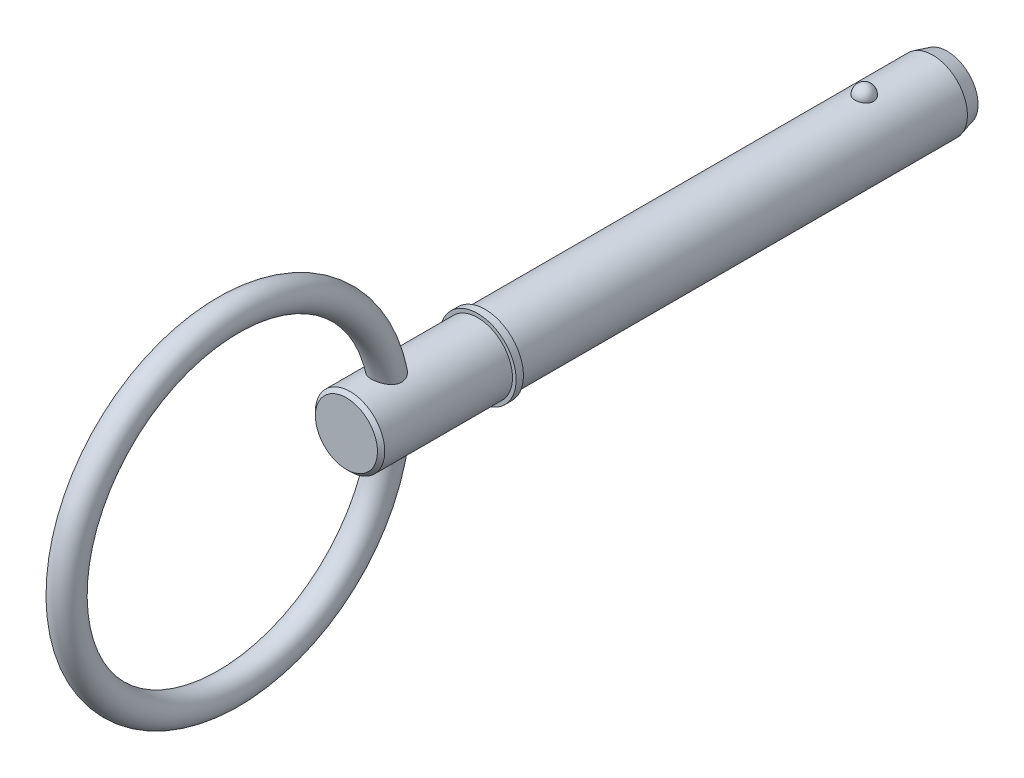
ISO-10303-21;
HEADER;
FILE_DESCRIPTION(('STEP AP214'),'2;1');
FILE_NAME('part.step','',(''),(''),'','','');
FILE_SCHEMA(('AUTOMOTIVE_DESIGN { 1 0 10303 214 1 1 1 1 }'));
ENDSEC;
DATA;
#1=APPLICATION_CONTEXT('core data for automotive mechanical design processes');
#2=APPLICATION_PROTOCOL_DEFINITION('international standard','automotive_design',2000,#1);
#3=PRODUCT_CONTEXT('',#1,'mechanical');
#4=PRODUCT('Part','Part','',(#3));
#5=PRODUCT_RELATED_PRODUCT_CATEGORY('part','',(#4));
#6=PRODUCT_DEFINITION_FORMATION('','',#4);
#7=PRODUCT_DEFINITION_CONTEXT('part definition',#1,'design');
#8=PRODUCT_DEFINITION('design','',#6,#7);
#9=PRODUCT_DEFINITION_SHAPE('','',#8);
#10=(LENGTH_UNIT() NAMED_UNIT(*) SI_UNIT(.MILLI.,.METRE.));
#11=(NAMED_UNIT(*) PLANE_ANGLE_UNIT() SI_UNIT($,.RADIAN.));
#12=(NAMED_UNIT(*) SI_UNIT($,.STERADIAN.) SOLID_ANGLE_UNIT());
#13=UNCERTAINTY_MEASURE_WITH_UNIT(LENGTH_MEASURE(1.E-05),#10,'distance_accuracy_value','');
#14=(GEOMETRIC_REPRESENTATION_CONTEXT(3) GLOBAL_UNCERTAINTY_ASSIGNED_CONTEXT((#13)) GLOBAL_UNIT_ASSIGNED_CONTEXT((#10,
#11,#12)) REPRESENTATION_CONTEXT('',''));
#15=CARTESIAN_POINT('',(0.,0.,0.));
#16=DIRECTION('',(0.,0.,1.));
#17=DIRECTION('',(1.,0.,0.));
#18=AXIS2_PLACEMENT_3D('',#15,#16,#17);
#19=CARTESIAN_POINT('',(0.,0.,50.8));
#20=DIRECTION('',(0.,0.,-1.));
#21=DIRECTION('',(-1.,0.,0.));
#22=AXIS2_PLACEMENT_3D('',#19,#20,#21);
#23=CYLINDRICAL_SURFACE('',#22,4.765);
#24=CARTESIAN_POINT('',(1.27812710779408,4.59038300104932,-1.29));
#25=CARTESIAN_POINT('',(1.27812572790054,4.59038414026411,-1.2178688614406));
#26=CARTESIAN_POINT('',(1.27223018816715,4.59203736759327,-1.14572000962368));
#27=CARTESIAN_POINT('',(1.24878929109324,4.59846646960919,-1.00346315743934));
#28=CARTESIAN_POINT('',(1.23123896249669,4.60324367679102,-0.933356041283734));
#29=CARTESIAN_POINT('',(1.18493861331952,4.61537801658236,-0.797215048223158));
#30=CARTESIAN_POINT('',(1.15619354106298,4.62273400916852,-0.731179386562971));
#31=CARTESIAN_POINT('',(1.08822596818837,4.6392032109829,-0.604986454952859));
#32=CARTESIAN_POINT('',(1.04900384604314,4.64831635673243,-0.544828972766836));
#33=CARTESIAN_POINT('',(0.960865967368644,4.66733302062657,-0.431775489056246));
#34=CARTESIAN_POINT('',(0.911906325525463,4.67723999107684,-0.37891426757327));
#35=CARTESIAN_POINT('',(0.805678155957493,4.69670280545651,-0.282245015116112));
#36=CARTESIAN_POINT('',(0.748409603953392,4.70625864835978,-0.238437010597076));
#37=CARTESIAN_POINT('',(0.627266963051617,4.72392767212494,-0.161207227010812));
#38=CARTESIAN_POINT('',(0.563411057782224,4.73204466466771,-0.127757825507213));
#39=CARTESIAN_POINT('',(0.430755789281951,4.74595788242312,-0.0720471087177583));
#40=CARTESIAN_POINT('',(0.361956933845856,4.75175434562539,-0.0497846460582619));
#41=CARTESIAN_POINT('',(0.222605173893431,4.76030056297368,-0.0173750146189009));
#42=CARTESIAN_POINT('',(0.152101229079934,4.76309991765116,-0.00703038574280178));
#43=CARTESIAN_POINT('',(0.0103009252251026,4.76551622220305,0.00191361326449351));
#44=CARTESIAN_POINT('',(-0.0609953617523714,4.76513345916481,0.000514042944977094));
#45=CARTESIAN_POINT('',(-0.201348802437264,4.76125496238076,-0.0138891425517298));
#46=CARTESIAN_POINT('',(-0.270423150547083,4.75780093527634,-0.0267372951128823));
#47=CARTESIAN_POINT('',(-0.405377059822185,4.74820737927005,-0.0634598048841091));
#48=CARTESIAN_POINT('',(-0.471256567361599,4.74206780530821,-0.0873343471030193));
#49=CARTESIAN_POINT('',(-0.598375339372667,4.72771507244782,-0.14561183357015));
#50=CARTESIAN_POINT('',(-0.659587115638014,4.71949070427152,-0.180071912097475));
#51=CARTESIAN_POINT('',(-0.775356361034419,4.70185936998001,-0.258542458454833));
#52=CARTESIAN_POINT('',(-0.8299131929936,4.69245229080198,-0.302553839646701));
#53=CARTESIAN_POINT('',(-0.931895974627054,4.67327936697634,-0.39982907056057));
#54=CARTESIAN_POINT('',(-0.979176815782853,4.66351011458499,-0.453244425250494));
#55=CARTESIAN_POINT('',(-1.06421220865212,4.64484426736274,-0.567321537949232));
#56=CARTESIAN_POINT('',(-1.10196613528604,4.63594772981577,-0.6279837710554));
#57=CARTESIAN_POINT('',(-1.16735225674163,4.61992036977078,-0.75558557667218));
#58=CARTESIAN_POINT('',(-1.19487251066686,4.61280933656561,-0.822585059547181));
#59=CARTESIAN_POINT('',(-1.23851975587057,4.60128324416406,-0.96041771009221));
#60=CARTESIAN_POINT('',(-1.25464705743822,4.59686811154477,-1.03125077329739));
#61=CARTESIAN_POINT('',(-1.27505790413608,4.59124882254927,-1.17443804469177));
#62=CARTESIAN_POINT('',(-1.27938868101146,4.59003186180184,-1.24678501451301));
#63=CARTESIAN_POINT('',(-1.27623192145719,4.5909105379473,-1.3911989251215));
#64=CARTESIAN_POINT('',(-1.26874468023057,4.59300609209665,-1.46326587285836));
#65=CARTESIAN_POINT('',(-1.24220427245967,4.60025423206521,-1.60473192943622));
#66=CARTESIAN_POINT('',(-1.2232043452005,4.60539274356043,-1.67414176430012));
#67=CARTESIAN_POINT('',(-1.17415910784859,4.61813957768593,-1.80870154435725));
#68=CARTESIAN_POINT('',(-1.1441133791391,4.62574799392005,-1.87385132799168));
#69=CARTESIAN_POINT('',(-1.07354327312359,4.64263368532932,-1.99841604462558));
#70=CARTESIAN_POINT('',(-1.03296580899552,4.65191934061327,-2.05779976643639));
#71=CARTESIAN_POINT('',(-0.942433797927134,4.67110036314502,-2.16881966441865));
#72=CARTESIAN_POINT('',(-0.892478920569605,4.68099575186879,-2.22045556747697));
#73=CARTESIAN_POINT('',(-0.784302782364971,4.70033161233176,-2.31471696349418));
#74=CARTESIAN_POINT('',(-0.726054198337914,4.70977043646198,-2.35731146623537));
#75=CARTESIAN_POINT('',(-0.602997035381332,4.72709995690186,-2.43206620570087));
#76=CARTESIAN_POINT('',(-0.538188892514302,4.73499075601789,-2.46422713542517));
#77=CARTESIAN_POINT('',(-0.404639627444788,4.7482563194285,-2.51687454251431));
#78=CARTESIAN_POINT('',(-0.335953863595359,4.7536596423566,-2.53749415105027));
#79=CARTESIAN_POINT('',(-0.195948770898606,4.76148510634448,-2.56703727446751));
#80=CARTESIAN_POINT('',(-0.124629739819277,4.76390758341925,-2.57596210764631));
#81=CARTESIAN_POINT('',(0.0172696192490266,4.76548774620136,-2.58180339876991));
#82=CARTESIAN_POINT('',(0.0878407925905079,4.76470225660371,-2.57892886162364));
#83=CARTESIAN_POINT('',(0.227467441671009,4.76008019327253,-2.56172603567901));
#84=CARTESIAN_POINT('',(0.296522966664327,4.75624371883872,-2.54739811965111));
#85=CARTESIAN_POINT('',(0.430942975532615,4.74595041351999,-2.50776251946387));
#86=CARTESIAN_POINT('',(0.496319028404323,4.7395023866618,-2.4824917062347));
#87=CARTESIAN_POINT('',(0.621860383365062,4.72467083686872,-2.4216730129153));
#88=CARTESIAN_POINT('',(0.682025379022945,4.71628720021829,-2.38612452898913));
#89=CARTESIAN_POINT('',(0.796409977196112,4.69833598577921,-2.30511163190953));
#90=CARTESIAN_POINT('',(0.850529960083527,4.68875291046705,-2.25951003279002));
#91=CARTESIAN_POINT('',(0.950412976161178,4.66953243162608,-2.15992428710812));
#92=CARTESIAN_POINT('',(0.996174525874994,4.65989501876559,-2.10593865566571));
#93=CARTESIAN_POINT('',(1.07885962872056,4.64145616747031,-1.99009376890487));
#94=CARTESIAN_POINT('',(1.11562789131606,4.63267081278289,-1.92812106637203));
#95=CARTESIAN_POINT('',(1.17840570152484,4.61710269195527,-1.79873681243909));
#96=CARTESIAN_POINT('',(1.20441973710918,4.61031909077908,-1.73132754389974));
#97=CARTESIAN_POINT('',(1.24242116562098,4.60021170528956,-1.60192906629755));
#98=CARTESIAN_POINT('',(1.25578772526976,4.59655387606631,-1.54036674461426));
#99=CARTESIAN_POINT('',(1.27364121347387,4.59163904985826,-1.41587409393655));
#100=CARTESIAN_POINT('',(1.2781283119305,4.59038200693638,-1.35294379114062));
#101=CARTESIAN_POINT('',(1.27812710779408,4.59038300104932,-1.29));
#102=B_SPLINE_CURVE_WITH_KNOTS('',3,(#24,#25,#26,#27,#28,#29,#30,#31,#32,#33,#34,#35,#36,#37,
#38,#39,#40,#41,#42,#43,#44,#45,#46,#47,#48,#49,#50,#51,#52,#53,#54,#55,#56,#57,#58,#59,#60,#61,
#62,#63,#64,#65,#66,#67,#68,#69,#70,#71,#72,#73,#74,#75,#76,#77,#78,#79,#80,#81,#82,#83,#84,#85,
#86,#87,#88,#89,#90,#91,#92,#93,#94,#95,#96,#97,#98,#99,#100,#101),.UNSPECIFIED.,.T.,.F.,(4,2,2,
2,2,2,2,2,2,2,2,2,2,2,2,2,2,2,2,2,2,2,2,2,2,2,2,2,2,2,2,2,2,2,2,2,2,2,4),(0.,0.216167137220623,
0.432426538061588,0.648590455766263,0.864746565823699,1.0818998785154,1.29905382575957,
1.51562361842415,1.73217119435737,1.94507683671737,2.15796327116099,2.36800220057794,
2.57804465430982,2.78924132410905,3.00045819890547,3.21545551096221,3.43046692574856,
3.64776550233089,3.8650581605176,4.08147951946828,4.29789547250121,4.51331818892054,
4.72874907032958,4.94528769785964,5.16183395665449,5.37911087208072,5.59637335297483,
5.8110751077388,6.02575265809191,6.23664413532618,6.44752874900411,6.65770827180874,
6.86790014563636,7.08116060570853,7.29445887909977,7.51121476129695,7.72788009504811,
7.91651762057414,8.10515153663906),.UNSPECIFIED.);
#103=CARTESIAN_POINT('',(1.27812710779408,4.59038300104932,-1.29));
#104=VERTEX_POINT('',#103);
#105=EDGE_CURVE('E103',#104,#104,#102,.T.);
#106=ORIENTED_EDGE('',*,*,#105,.T.);
#107=EDGE_LOOP('',(#106));
#108=FACE_BOUND('',#107,.T.);
#109=CARTESIAN_POINT('',(0.,0.,-10.7));
#110=DIRECTION('',(0.,0.,-1.));
#111=DIRECTION('',(-1.,0.,0.));
#112=AXIS2_PLACEMENT_3D('',#109,#110,#111);
#113=CIRCLE('',#112,4.765);
#114=CARTESIAN_POINT('',(-4.765,0.,-10.7));
#115=VERTEX_POINT('',#114);
#116=EDGE_CURVE('E110',#115,#115,#113,.F.);
#117=ORIENTED_EDGE('',*,*,#116,.T.);
#118=EDGE_LOOP('',(#117));
#119=FACE_BOUND('',#118,.T.);
#120=CARTESIAN_POINT('',(0.,0.,50.8));
#121=DIRECTION('',(0.,0.,1.));
#122=DIRECTION('',(1.,0.,0.));
#123=AXIS2_PLACEMENT_3D('',#120,#121,#122);
#124=CIRCLE('',#123,4.765);
#125=CARTESIAN_POINT('',(4.765,0.,50.8));
#126=VERTEX_POINT('',#125);
#127=EDGE_CURVE('E108',#126,#126,#124,.T.);
#128=ORIENTED_EDGE('',*,*,#127,.F.);
#129=EDGE_LOOP('',(#128));
#130=FACE_BOUND('',#129,.T.);
#131=ADVANCED_FACE('F39',(#108,#119,#130),#23,.T.);
#132=CARTESIAN_POINT('',(0.,0.,-12.7));
#133=DIRECTION('',(0.,0.,-1.));
#134=DIRECTION('',(-1.,0.,0.));
#135=AXIS2_PLACEMENT_3D('',#132,#133,#134);
#136=PLANE('',#135);
#137=CARTESIAN_POINT('',(0.,0.,-12.7));
#138=DIRECTION('',(0.,0.,-1.));
#139=DIRECTION('',(-1.,0.,0.));
#140=AXIS2_PLACEMENT_3D('',#137,#138,#139);
#141=CIRCLE('',#140,4.22910161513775);
#142=CARTESIAN_POINT('',(-4.22910161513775,0.,-12.7));
#143=VERTEX_POINT('',#142);
#144=EDGE_CURVE('E141',#143,#143,#141,.T.);
#145=ORIENTED_EDGE('',*,*,#144,.T.);
#146=EDGE_LOOP('',(#145));
#147=FACE_BOUND('',#146,.T.);
#148=ADVANCED_FACE('F89',(#147),#136,.T.);
#149=CARTESIAN_POINT('',(0.,0.,-12.7));
#150=DIRECTION('',(0.,0.,1.));
#151=DIRECTION('',(1.,0.,0.));
#152=AXIS2_PLACEMENT_3D('',#149,#150,#151);
#153=CONICAL_SURFACE('',#152,4.22910161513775,0.261799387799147);
#154=ORIENTED_EDGE('',*,*,#116,.F.);
#155=EDGE_LOOP('',(#154));
#156=FACE_BOUND('',#155,.T.);
#157=ORIENTED_EDGE('',*,*,#144,.F.);
#158=EDGE_LOOP('',(#157));
#159=FACE_BOUND('',#158,.T.);
#160=ADVANCED_FACE('F95',(#156,#159),#153,.T.);
#161=CARTESIAN_POINT('',(0.,4.765,-1.29));
#162=DIRECTION('',(0.,1.,0.));
#163=DIRECTION('',(0.,0.,-1.));
#164=AXIS2_PLACEMENT_3D('',#161,#162,#163);
#165=SPHERICAL_SURFACE('',#164,1.29);
#166=ORIENTED_EDGE('',*,*,#105,.F.);
#167=EDGE_LOOP('',(#166));
#168=FACE_BOUND('',#167,.T.);
#169=ADVANCED_FACE('F113',(#168),#165,.T.);
#170=CARTESIAN_POINT('',(0.,0.,50.8));
#171=DIRECTION('',(0.,0.,-1.));
#172=DIRECTION('',(-1.,0.,0.));
#173=AXIS2_PLACEMENT_3D('',#170,#171,#172);
#174=PLANE('',#173);
#175=ORIENTED_EDGE('',*,*,#127,.T.);
#176=EDGE_LOOP('',(#175));
#177=FACE_BOUND('',#176,.T.);
#178=CARTESIAN_POINT('',(0.,0.,50.8));
#179=DIRECTION('',(0.,0.,-1.));
#180=DIRECTION('',(-1.,0.,0.));
#181=AXIS2_PLACEMENT_3D('',#178,#179,#180);
#182=CIRCLE('',#181,5.265);
#183=CARTESIAN_POINT('',(-5.265,0.,50.8));
#184=VERTEX_POINT('',#183);
#185=EDGE_CURVE('E109',#184,#184,#182,.T.);
#186=ORIENTED_EDGE('',*,*,#185,.T.);
#187=EDGE_LOOP('',(#186));
#188=FACE_BOUND('',#187,.T.);
#189=ADVANCED_FACE('F117',(#177,#188),#174,.T.);
#190=CARTESIAN_POINT('',(0.,0.,33.7287874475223));
#191=DIRECTION('',(0.,0.,-1.));
#192=DIRECTION('',(-1.,0.,0.));
#193=AXIS2_PLACEMENT_3D('',#190,#191,#192);
#194=CYLINDRICAL_SURFACE('',#193,5.265);
#195=CARTESIAN_POINT('',(0.,0.,51.8));
#196=DIRECTION('',(0.,0.,-1.));
#197=DIRECTION('',(-1.,0.,0.));
#198=AXIS2_PLACEMENT_3D('',#195,#196,#197);
#199=CIRCLE('',#198,5.265);
#200=CARTESIAN_POINT('',(-5.265,0.,51.8));
#201=VERTEX_POINT('',#200);
#202=EDGE_CURVE('E134',#201,#201,#199,.T.);
#203=ORIENTED_EDGE('',*,*,#202,.T.);
#204=EDGE_LOOP('',(#203));
#205=FACE_BOUND('',#204,.T.);
#206=ORIENTED_EDGE('',*,*,#185,.F.);
#207=EDGE_LOOP('',(#206));
#208=FACE_BOUND('',#207,.T.);
#209=ADVANCED_FACE('F121',(#205,#208),#194,.T.);
#210=CARTESIAN_POINT('',(0.,5.265,51.8));
#211=DIRECTION('',(0.,0.,1.));
#212=DIRECTION('',(1.,0.,0.));
#213=AXIS2_PLACEMENT_3D('',#210,#211,#212);
#214=PLANE('',#213);
#215=CARTESIAN_POINT('',(0.,0.,51.8));
#216=DIRECTION('',(0.,0.,1.));
#217=DIRECTION('',(1.,0.,0.));
#218=AXIS2_PLACEMENT_3D('',#215,#216,#217);
#219=CIRCLE('',#218,4.765);
#220=CARTESIAN_POINT('',(4.765,0.,51.8));
#221=VERTEX_POINT('',#220);
#222=EDGE_CURVE('E112',#221,#221,#219,.T.);
#223=ORIENTED_EDGE('',*,*,#222,.F.);
#224=EDGE_LOOP('',(#223));
#225=FACE_BOUND('',#224,.T.);
#226=ORIENTED_EDGE('',*,*,#202,.F.);
#227=EDGE_LOOP('',(#226));
#228=FACE_BOUND('',#227,.T.);
#229=ADVANCED_FACE('F86',(#225,#228),#214,.T.);
#230=CARTESIAN_POINT('',(0.,0.,69.85));
#231=DIRECTION('',(0.,0.,-1.));
#232=DIRECTION('',(-1.,0.,0.));
#233=AXIS2_PLACEMENT_3D('',#230,#231,#232);
#234=CYLINDRICAL_SURFACE('',#233,4.765);
#235=CARTESIAN_POINT('',(-1.17603588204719,-4.61759294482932,62.6837200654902));
#236=CARTESIAN_POINT('',(-1.08605054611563,-4.6405075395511,62.6215688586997));
#237=CARTESIAN_POINT('',(-0.990486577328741,-4.66202408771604,62.5667393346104));
#238=CARTESIAN_POINT('',(-0.790762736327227,-4.70002969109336,62.4729957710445));
#239=CARTESIAN_POINT('',(-0.686587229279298,-4.7165093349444,62.4341114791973));
#240=CARTESIAN_POINT('',(-0.472539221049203,-4.7427361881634,62.373267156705));
#241=CARTESIAN_POINT('',(-0.362665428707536,-4.75248186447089,62.3513109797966));
#242=CARTESIAN_POINT('',(-0.140482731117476,-4.7642267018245,62.3249366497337));
#243=CARTESIAN_POINT('',(-0.028175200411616,-4.7662301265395,62.3205088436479));
#244=CARTESIAN_POINT('',(0.193745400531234,-4.76233166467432,62.3292082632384));
#245=CARTESIAN_POINT('',(0.303372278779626,-4.75656024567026,62.3420457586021));
#246=CARTESIAN_POINT('',(0.51872430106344,-4.73791484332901,62.3844340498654));
#247=CARTESIAN_POINT('',(0.624448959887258,-4.72503997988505,62.4139869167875));
#248=CARTESIAN_POINT('',(0.829434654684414,-4.69340588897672,62.4892085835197));
#249=CARTESIAN_POINT('',(0.928674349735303,-4.6746283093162,62.5349277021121));
#250=CARTESIAN_POINT('',(1.11777413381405,-4.63305392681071,62.6414733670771));
#251=CARTESIAN_POINT('',(1.20763216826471,-4.61025624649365,62.7023032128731));
#252=CARTESIAN_POINT('',(1.37762760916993,-4.56238439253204,62.8394393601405));
#253=CARTESIAN_POINT('',(1.45749020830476,-4.53726959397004,62.9160728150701));
#254=CARTESIAN_POINT('',(1.60275140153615,-4.48801828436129,63.0822939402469));
#255=CARTESIAN_POINT('',(1.66815155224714,-4.46388166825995,63.171880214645));
#256=CARTESIAN_POINT('',(1.78162069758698,-4.41980966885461,63.3604689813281));
#257=CARTESIAN_POINT('',(1.82993675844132,-4.3998162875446,63.4593086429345));
#258=CARTESIAN_POINT('',(1.90902953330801,-4.36608532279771,63.6647395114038));
#259=CARTESIAN_POINT('',(1.93981696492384,-4.35234391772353,63.7713259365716));
#260=CARTESIAN_POINT('',(1.9818112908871,-4.33337618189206,63.982380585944));
#261=CARTESIAN_POINT('',(1.99406945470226,-4.32769391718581,64.08660066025));
#262=CARTESIAN_POINT('',(2.0025484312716,-4.32377679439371,64.2958125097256));
#263=CARTESIAN_POINT('',(1.99876733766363,-4.32554282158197,64.4008043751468));
#264=CARTESIAN_POINT('',(1.97595504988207,-4.33600911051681,64.6091056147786));
#265=CARTESIAN_POINT('',(1.95686739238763,-4.3447350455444,64.7124073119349));
#266=CARTESIAN_POINT('',(1.90457346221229,-4.36790947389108,64.9146792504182));
#267=CARTESIAN_POINT('',(1.87136191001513,-4.38236010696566,65.0136478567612));
#268=CARTESIAN_POINT('',(1.78747856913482,-4.41728816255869,65.2164706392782));
#269=CARTESIAN_POINT('',(1.73524632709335,-4.43826528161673,65.3195927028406));
#270=CARTESIAN_POINT('',(1.61607256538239,-4.48303292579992,65.5163865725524));
#271=CARTESIAN_POINT('',(1.54911576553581,-4.50682636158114,65.6100484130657));
#272=CARTESIAN_POINT('',(1.39359064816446,-4.55746895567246,65.7953838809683));
#273=CARTESIAN_POINT('',(1.30346928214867,-4.58437060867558,65.8857503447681));
#274=CARTESIAN_POINT('',(1.10794390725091,-4.6354985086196,66.0490111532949));
#275=CARTESIAN_POINT('',(1.0025593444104,-4.65972809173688,66.1219274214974));
#276=CARTESIAN_POINT('',(0.803761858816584,-4.69755503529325,66.2324077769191));
#277=CARTESIAN_POINT('',(0.71293567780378,-4.71231838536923,66.2742306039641));
#278=CARTESIAN_POINT('',(0.525172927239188,-4.73691370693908,66.3429362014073));
#279=CARTESIAN_POINT('',(0.428242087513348,-4.74675022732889,66.3698327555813));
#280=CARTESIAN_POINT('',(0.230351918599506,-4.76046566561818,66.4071470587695));
#281=CARTESIAN_POINT('',(0.129376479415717,-4.76431768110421,66.4174904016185));
#282=CARTESIAN_POINT('',(-0.0728965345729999,-4.76551495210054,66.4207168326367));
#283=CARTESIAN_POINT('',(-0.174194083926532,-4.76286070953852,66.4136012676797));
#284=CARTESIAN_POINT('',(-0.366467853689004,-4.751792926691,66.3835798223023));
#285=CARTESIAN_POINT('',(-0.457659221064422,-4.74381187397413,66.3618588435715));
#286=CARTESIAN_POINT('',(-0.635226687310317,-4.72331548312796,66.3050844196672));
#287=CARTESIAN_POINT('',(-0.721601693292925,-4.71079912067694,66.2700279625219));
#288=CARTESIAN_POINT('',(-0.89321257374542,-4.68139468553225,66.1855597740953));
#289=CARTESIAN_POINT('',(-0.978027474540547,-4.66427939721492,66.1353775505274));
#290=CARTESIAN_POINT('',(-1.13917803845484,-4.62756330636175,66.0236420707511));
#291=CARTESIAN_POINT('',(-1.21550961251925,-4.60796131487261,65.9620833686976));
#292=CARTESIAN_POINT('',(-1.3703354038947,-4.56452178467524,65.8186885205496));
#293=CARTESIAN_POINT('',(-1.44723650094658,-4.5405070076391,65.7351843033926));
#294=CARTESIAN_POINT('',(-1.58763850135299,-4.49334232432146,65.5572920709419));
#295=CARTESIAN_POINT('',(-1.65112672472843,-4.47019325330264,65.4628938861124));
#296=CARTESIAN_POINT('',(-1.7703324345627,-4.42444393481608,65.2532060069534));
#297=CARTESIAN_POINT('',(-1.82420433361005,-4.40224259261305,65.1367685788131));
#298=CARTESIAN_POINT('',(-1.9116908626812,-4.36496831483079,64.8954090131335));
#299=CARTESIAN_POINT('',(-1.94531523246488,-4.3498919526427,64.7704909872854));
#300=CARTESIAN_POINT('',(-1.98892523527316,-4.33012255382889,64.5220163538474));
#301=CARTESIAN_POINT('',(-1.99998275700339,-4.32495941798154,64.3986899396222));
#302=CARTESIAN_POINT('',(-2.00001713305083,-4.32494814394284,64.152073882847));
#303=CARTESIAN_POINT('',(-1.98902141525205,-4.33008719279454,64.0287843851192));
#304=CARTESIAN_POINT('',(-1.94752572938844,-4.34888267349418,63.80321378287));
#305=CARTESIAN_POINT('',(-1.91979754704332,-4.3613227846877,63.7003106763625));
#306=CARTESIAN_POINT('',(-1.8480559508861,-4.39220107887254,63.5012512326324));
#307=CARTESIAN_POINT('',(-1.80403476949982,-4.41064212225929,63.4050981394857));
#308=CARTESIAN_POINT('',(-1.70232000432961,-4.4508689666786,63.2244579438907));
#309=CARTESIAN_POINT('',(-1.64499853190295,-4.47255887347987,63.1397380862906));
#310=CARTESIAN_POINT('',(-1.51770958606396,-4.51733419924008,62.981012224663));
#311=CARTESIAN_POINT('',(-1.44776268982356,-4.54041730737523,62.9069891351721));
#312=CARTESIAN_POINT('',(-1.34143544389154,-4.57239833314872,62.81104340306));
#313=CARTESIAN_POINT('',(-1.30955259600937,-4.58164274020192,62.7841153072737));
#314=CARTESIAN_POINT('',(-1.24406394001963,-4.59985727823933,62.7323409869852));
#315=CARTESIAN_POINT('',(-1.21045807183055,-4.6088273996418,62.7074948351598));
#316=CARTESIAN_POINT('',(-1.17603588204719,-4.61759294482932,62.6837200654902));
#317=B_SPLINE_CURVE_WITH_KNOTS('',3,(#235,#236,#237,#238,#239,#240,#241,#242,#243,#244,#245,
#246,#247,#248,#249,#250,#251,#252,#253,#254,#255,#256,#257,#258,#259,#260,#261,#262,#263,#264,
#265,#266,#267,#268,#269,#270,#271,#272,#273,#274,#275,#276,#277,#278,#279,#280,#281,#282,#283,
#284,#285,#286,#287,#288,#289,#290,#291,#292,#293,#294,#295,#296,#297,#298,#299,#300,#301,#302,
#303,#304,#305,#306,#307,#308,#309,#310,#311,#312,#313,#314,#315,#316),.UNSPECIFIED.,.T.,.F.,(4,
2,2,2,2,2,2,2,2,2,2,2,2,2,2,2,2,2,2,2,2,2,2,2,2,2,2,2,2,2,2,2,2,2,2,2,2,2,2,2,4),(0.,
0.335054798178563,0.670731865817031,1.00648532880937,1.34205386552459,1.6720608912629,
2.00210881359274,2.33319321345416,2.66434996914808,3.00321157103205,3.34203668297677,
3.67573940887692,4.00923787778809,4.32299322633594,4.6367858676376,4.95174139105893,
5.26681474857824,5.6178575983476,5.96926647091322,6.35862694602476,6.74749565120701,
7.04947204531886,7.35116911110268,7.65421852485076,7.95724456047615,8.23825252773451,
8.51932400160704,8.81825171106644,9.11732288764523,9.46404422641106,9.81109188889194,
10.1997682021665,10.5882573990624,10.9578189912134,11.32692124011,11.6472091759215,
11.9676500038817,12.2800235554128,12.5918925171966,12.7200569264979,12.8482258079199),.UNSPECIFIED.);
#318=CARTESIAN_POINT('',(-1.17603588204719,-4.61759294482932,62.6837200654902));
#319=VERTEX_POINT('',#318);
#320=EDGE_CURVE('E10',#319,#319,#317,.T.);
#321=ORIENTED_EDGE('',*,*,#320,.F.);
#322=EDGE_LOOP('',(#321));
#323=FACE_BOUND('',#322,.T.);
#324=CARTESIAN_POINT('',(-1.17603588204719,4.61759294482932,62.6837200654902));
#325=CARTESIAN_POINT('',(-1.26499234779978,4.59493450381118,62.7451699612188));
#326=CARTESIAN_POINT('',(-1.34870034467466,4.57085993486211,62.8139152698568));
#327=CARTESIAN_POINT('',(-1.50334626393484,4.52236448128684,62.964635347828));
#328=CARTESIAN_POINT('',(-1.57425996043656,4.49794303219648,63.0466346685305));
#329=CARTESIAN_POINT('',(-1.7013018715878,4.45144771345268,63.2222345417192));
#330=CARTESIAN_POINT('',(-1.75740699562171,4.42937754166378,63.3158528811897));
#331=CARTESIAN_POINT('',(-1.85287755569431,4.3903018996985,63.5121668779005));
#332=CARTESIAN_POINT('',(-1.89225871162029,4.37329167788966,63.6148539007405));
#333=CARTESIAN_POINT('',(-1.95188661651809,4.34699775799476,63.8218576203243));
#334=CARTESIAN_POINT('',(-1.97286468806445,4.33742068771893,63.9259265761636));
#335=CARTESIAN_POINT('',(-1.99814509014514,4.32583397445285,64.1364714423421));
#336=CARTESIAN_POINT('',(-2.00244696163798,4.32382453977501,64.2429474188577));
#337=CARTESIAN_POINT('',(-1.99499900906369,4.32726361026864,64.4527706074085));
#338=CARTESIAN_POINT('',(-1.9836061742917,4.33254625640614,64.556134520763));
#339=CARTESIAN_POINT('',(-1.94643618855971,4.34936983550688,64.7596911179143));
#340=CARTESIAN_POINT('',(-1.92065444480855,4.3609127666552,64.8598827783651));
#341=CARTESIAN_POINT('',(-1.85292379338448,4.3901452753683,65.0641042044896));
#342=CARTESIAN_POINT('',(-1.80971134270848,4.40830066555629,65.1676462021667));
#343=CARTESIAN_POINT('',(-1.70892742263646,4.44833985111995,65.3667684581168));
#344=CARTESIAN_POINT('',(-1.65134284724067,4.47022704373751,65.4623413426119));
#345=CARTESIAN_POINT('',(-1.51475300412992,4.51847764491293,65.6552600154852));
#346=CARTESIAN_POINT('',(-1.43395667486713,4.54505660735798,65.7512914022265));
#347=CARTESIAN_POINT('',(-1.25684082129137,4.59718102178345,65.9281328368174));
#348=CARTESIAN_POINT('',(-1.16053129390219,4.62272712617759,66.0089526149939));
#349=CARTESIAN_POINT('',(-0.972192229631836,4.66558476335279,66.1393265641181));
#350=CARTESIAN_POINT('',(-0.882391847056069,4.68355428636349,66.1918799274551));
#351=CARTESIAN_POINT('',(-0.694836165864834,4.71502283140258,66.2820221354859));
#352=CARTESIAN_POINT('',(-0.597087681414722,4.72852563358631,66.3196236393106));
#353=CARTESIAN_POINT('',(-0.39532174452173,4.74966109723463,66.3778751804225));
#354=CARTESIAN_POINT('',(-0.291269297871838,4.75725698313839,66.3984190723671));
#355=CARTESIAN_POINT('',(-0.0808979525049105,4.76547327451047,66.4206246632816));
#356=CARTESIAN_POINT('',(0.025419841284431,4.76609700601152,66.4222953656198));
#357=CARTESIAN_POINT('',(0.225327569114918,4.7606097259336,66.4074850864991));
#358=CARTESIAN_POINT('',(0.319084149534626,4.75519734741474,66.3928871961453));
#359=CARTESIAN_POINT('',(0.502750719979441,4.73930039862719,66.3493972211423));
#360=CARTESIAN_POINT('',(0.592660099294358,4.7288150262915,66.320502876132));
#361=CARTESIAN_POINT('',(0.7687773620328,4.70343779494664,66.2490413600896));
#362=CARTESIAN_POINT('',(0.854839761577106,4.68844387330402,66.2061552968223));
#363=CARTESIAN_POINT('',(1.01943666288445,4.65543047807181,66.1087469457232));
#364=CARTESIAN_POINT('',(1.09796821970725,4.63740982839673,66.0542201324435));
#365=CARTESIAN_POINT('',(1.25751825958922,4.59691257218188,65.9264656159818));
#366=CARTESIAN_POINT('',(1.33721103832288,4.57417011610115,65.8516678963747));
#367=CARTESIAN_POINT('',(1.48461190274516,4.52847869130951,65.6910829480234));
#368=CARTESIAN_POINT('',(1.55230949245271,4.50552956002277,65.6052862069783));
#369=CARTESIAN_POINT('',(1.68366050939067,4.45825797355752,65.4114045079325));
#370=CARTESIAN_POINT('',(1.74532014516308,4.43421533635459,65.3018899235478));
#371=CARTESIAN_POINT('',(1.85007805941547,4.39154308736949,65.0732696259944));
#372=CARTESIAN_POINT('',(1.89317429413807,4.37291407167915,64.9541628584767));
#373=CARTESIAN_POINT('',(1.958572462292,4.34402041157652,64.7097631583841));
#374=CARTESIAN_POINT('',(1.98095022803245,4.33372528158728,64.584494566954));
#375=CARTESIAN_POINT('',(2.00301292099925,4.32358016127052,64.3315942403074));
#376=CARTESIAN_POINT('',(2.00273000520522,4.32371536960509,64.2039661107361));
#377=CARTESIAN_POINT('',(1.97997568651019,4.3341693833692,63.9682474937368));
#378=CARTESIAN_POINT('',(1.96044562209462,4.34313814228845,63.8598066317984));
#379=CARTESIAN_POINT('',(1.90368145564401,4.36831534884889,63.6485431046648));
#380=CARTESIAN_POINT('',(1.86644884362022,4.38452318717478,63.5457199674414));
#381=CARTESIAN_POINT('',(1.7781154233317,4.42104679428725,63.3547100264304));
#382=CARTESIAN_POINT('',(1.72797707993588,4.44105894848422,63.2660156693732));
#383=CARTESIAN_POINT('',(1.61439500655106,4.48359504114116,63.0982868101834));
#384=CARTESIAN_POINT('',(1.55094927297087,4.50611935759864,63.0192537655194));
#385=CARTESIAN_POINT('',(1.40889349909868,4.55259151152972,62.8687053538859));
#386=CARTESIAN_POINT('',(1.32968750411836,4.57655455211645,62.7977571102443));
#387=CARTESIAN_POINT('',(1.16035884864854,4.62238936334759,62.6695060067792));
#388=CARTESIAN_POINT('',(1.07023361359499,4.64426063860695,62.6122063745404));
#389=CARTESIAN_POINT('',(0.877362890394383,4.68460759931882,62.5103166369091));
#390=CARTESIAN_POINT('',(0.774249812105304,4.70290564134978,62.4663495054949));
#391=CARTESIAN_POINT('',(0.561430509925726,4.73302876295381,62.3954843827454));
#392=CARTESIAN_POINT('',(0.451725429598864,4.74485496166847,62.3685834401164));
#393=CARTESIAN_POINT('',(0.230282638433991,4.76071009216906,62.3327633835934));
#394=CARTESIAN_POINT('',(0.118587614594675,4.76483485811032,62.3236232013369));
#395=CARTESIAN_POINT('',(-0.104911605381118,4.76515532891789,62.3229082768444));
#396=CARTESIAN_POINT('',(-0.216715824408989,4.76134861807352,62.3313388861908));
#397=CARTESIAN_POINT('',(-0.435231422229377,4.74632552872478,62.3652456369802));
#398=CARTESIAN_POINT('',(-0.541996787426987,4.73523460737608,62.3904332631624));
#399=CARTESIAN_POINT('',(-0.749371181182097,4.70686626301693,62.4569215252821));
#400=CARTESIAN_POINT('',(-0.849990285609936,4.68959930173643,62.4981949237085));
#401=CARTESIAN_POINT('',(-0.986108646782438,4.6620261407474,62.5672359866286));
#402=CARTESIAN_POINT('',(-1.02525769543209,4.65355983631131,62.5887724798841));
#403=CARTESIAN_POINT('',(-1.10191286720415,4.63600664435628,62.6343673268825));
#404=CARTESIAN_POINT('',(-1.13941901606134,4.62691976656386,62.658425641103));
#405=CARTESIAN_POINT('',(-1.17603588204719,4.61759294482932,62.6837200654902));
#406=B_SPLINE_CURVE_WITH_KNOTS('',3,(#324,#325,#326,#327,#328,#329,#330,#331,#332,#333,#334,
#335,#336,#337,#338,#339,#340,#341,#342,#343,#344,#345,#346,#347,#348,#349,#350,#351,#352,#353,
#354,#355,#356,#357,#358,#359,#360,#361,#362,#363,#364,#365,#366,#367,#368,#369,#370,#371,#372,
#373,#374,#375,#376,#377,#378,#379,#380,#381,#382,#383,#384,#385,#386,#387,#388,#389,#390,#391,
#392,#393,#394,#395,#396,#397,#398,#399,#400,#401,#402,#403,#404,#405),.UNSPECIFIED.,.T.,.F.,(4,
2,2,2,2,2,2,2,2,2,2,2,2,2,2,2,2,2,2,2,2,2,2,2,2,2,2,2,2,2,2,2,2,2,2,2,2,2,2,2,4),(0.,
0.331234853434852,0.66309046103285,0.995460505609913,1.3275174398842,1.64568783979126,
1.96386699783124,2.27492717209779,2.5860866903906,2.92571998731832,3.26566413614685,
3.64875195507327,4.03159388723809,4.34706664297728,4.66227172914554,4.97942386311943,
5.29642469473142,5.58021908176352,5.86405835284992,6.15488068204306,6.44581627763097,
6.77943874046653,7.11335170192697,7.49545660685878,7.87760356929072,8.25834622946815,
8.63854860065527,8.96843568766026,9.29829501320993,9.60842872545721,9.91860916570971,
10.2441707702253,10.5698092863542,10.9089029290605,11.2479379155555,11.5827251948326,
11.9176144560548,12.2468820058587,12.5755944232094,12.7119417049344,12.8482868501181),.UNSPECIFIED.);
#407=CARTESIAN_POINT('',(-1.17603588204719,4.61759294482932,62.6837200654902));
#408=VERTEX_POINT('',#407);
#409=EDGE_CURVE('E51',#408,#408,#406,.T.);
#410=ORIENTED_EDGE('',*,*,#409,.F.);
#411=EDGE_LOOP('',(#410));
#412=FACE_BOUND('',#411,.T.);
#413=CARTESIAN_POINT('',(0.,0.,69.35));
#414=DIRECTION('',(0.,0.,-1.));
#415=DIRECTION('',(-1.,0.,0.));
#416=AXIS2_PLACEMENT_3D('',#413,#414,#415);
#417=CIRCLE('',#416,4.765);
#418=CARTESIAN_POINT('',(-4.765,0.,69.35));
#419=VERTEX_POINT('',#418);
#420=EDGE_CURVE('E65',#419,#419,#417,.T.);
#421=ORIENTED_EDGE('',*,*,#420,.T.);
#422=EDGE_LOOP('',(#421));
#423=FACE_BOUND('',#422,.T.);
#424=ORIENTED_EDGE('',*,*,#222,.T.);
#425=EDGE_LOOP('',(#424));
#426=FACE_BOUND('',#425,.T.);
#427=ADVANCED_FACE('F70',(#323,#412,#423,#426),#234,.T.);
#428=CARTESIAN_POINT('',(0.,0.,69.85));
#429=DIRECTION('',(0.,0.,-1.));
#430=DIRECTION('',(-1.,0.,0.));
#431=AXIS2_PLACEMENT_3D('',#428,#429,#430);
#432=PLANE('',#431);
#433=CARTESIAN_POINT('',(0.,0.,69.85));
#434=DIRECTION('',(0.,0.,-1.));
#435=DIRECTION('',(-1.,0.,0.));
#436=AXIS2_PLACEMENT_3D('',#433,#434,#435);
#437=CIRCLE('',#436,4.26499999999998);
#438=CARTESIAN_POINT('',(-4.26499999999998,0.,69.85));
#439=VERTEX_POINT('',#438);
#440=EDGE_CURVE('E58',#439,#439,#437,.F.);
#441=ORIENTED_EDGE('',*,*,#440,.T.);
#442=EDGE_LOOP('',(#441));
#443=FACE_BOUND('',#442,.T.);
#444=ADVANCED_FACE('F77',(#443),#432,.F.);
#445=CARTESIAN_POINT('',(0.,0.,69.35));
#446=DIRECTION('',(0.,0.,-1.));
#447=DIRECTION('',(-1.,0.,0.));
#448=AXIS2_PLACEMENT_3D('',#445,#446,#447);
#449=CONICAL_SURFACE('',#448,4.765,0.785398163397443);
#450=ORIENTED_EDGE('',*,*,#440,.F.);
#451=EDGE_LOOP('',(#450));
#452=FACE_BOUND('',#451,.T.);
#453=ORIENTED_EDGE('',*,*,#420,.F.);
#454=EDGE_LOOP('',(#453));
#455=FACE_BOUND('',#454,.T.);
#456=ADVANCED_FACE('F41',(#452,#455),#449,.T.);
#457=CARTESIAN_POINT('',(0.,0.,86.075));
#458=DIRECTION('',(1.,0.,0.));
#459=DIRECTION('',(0.,0.,-1.));
#460=AXIS2_PLACEMENT_3D('',#457,#458,#459);
#461=TOROIDAL_SURFACE('',#460,22.225,2.);
#462=ORIENTED_EDGE('',*,*,#320,.T.);
#463=EDGE_LOOP('',(#462));
#464=FACE_BOUND('',#463,.T.);
#465=ORIENTED_EDGE('',*,*,#409,.T.);
#466=EDGE_LOOP('',(#465));
#467=FACE_BOUND('',#466,.T.);
#468=ADVANCED_FACE('F74',(#464,#467),#461,.T.);
#469=CLOSED_SHELL('',(#131,#148,#160,#169,#189,#209,#229,#427,#444,#456,#468));
#470=MANIFOLD_SOLID_BREP('B2',#469);
#471=ADVANCED_BREP_SHAPE_REPRESENTATION('',(#18,#470),#14);
#472=SHAPE_DEFINITION_REPRESENTATION(#9,#471);
ENDSEC;
END-ISO-10303-21;
